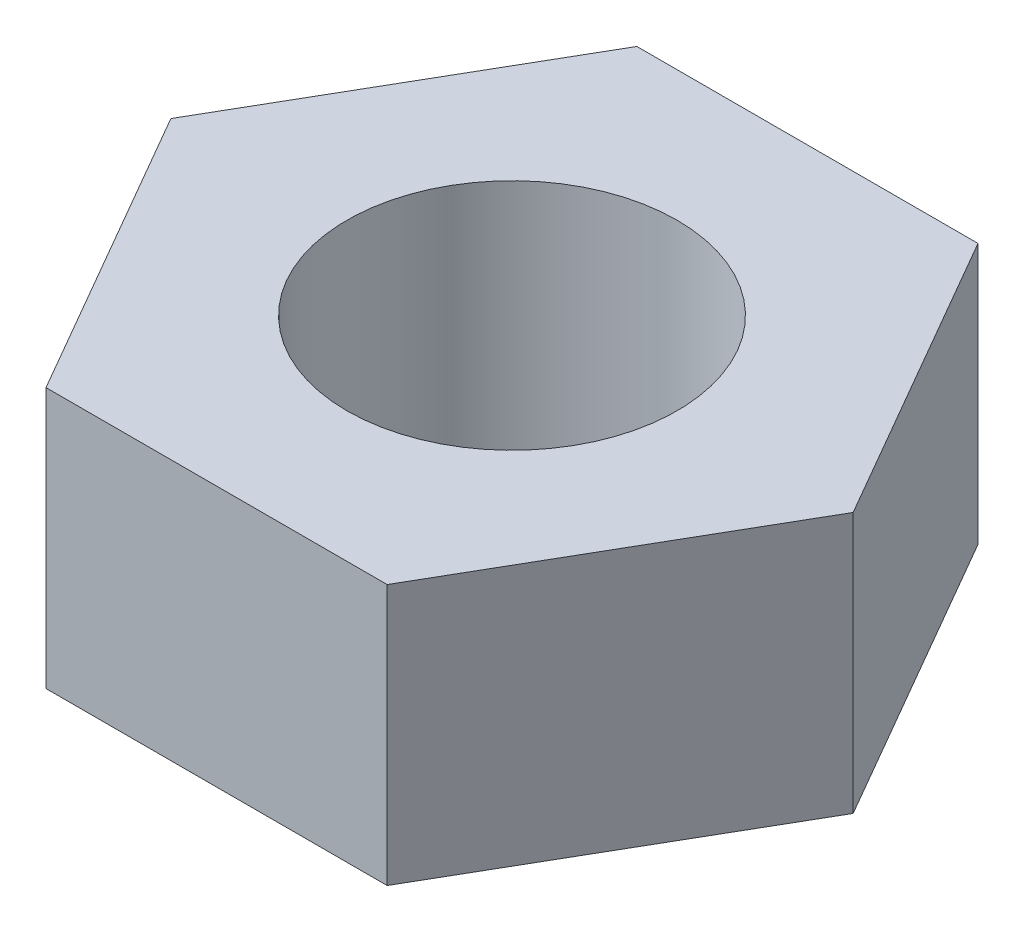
from build123d import *

# Parameters (mm, degrees)
SKETCH1_R           = 1.9
BOSS_EXTRUDE1_DEPTH = 3


with BuildPart() as part:
    # Sketch1 → Boss-Extrude1 (new body)
    with BuildSketch(Plane(origin=(0, 0, 0), x_dir=(1, 0, 0), z_dir=(0, 1, 0))):
        Polygon((3.92598183, 0), (1.962990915, 3.4), (-1.962990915, 3.4), (-3.92598183, 0), (-1.962990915, -3.4), (1.962990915, -3.4), align=None)
        with Locations(Location((0, 0, 0), (0, 0, 270))):
            Circle(SKETCH1_R, mode=Mode.SUBTRACT)
    extrude(amount=BOSS_EXTRUDE1_DEPTH)


solid = part.part
